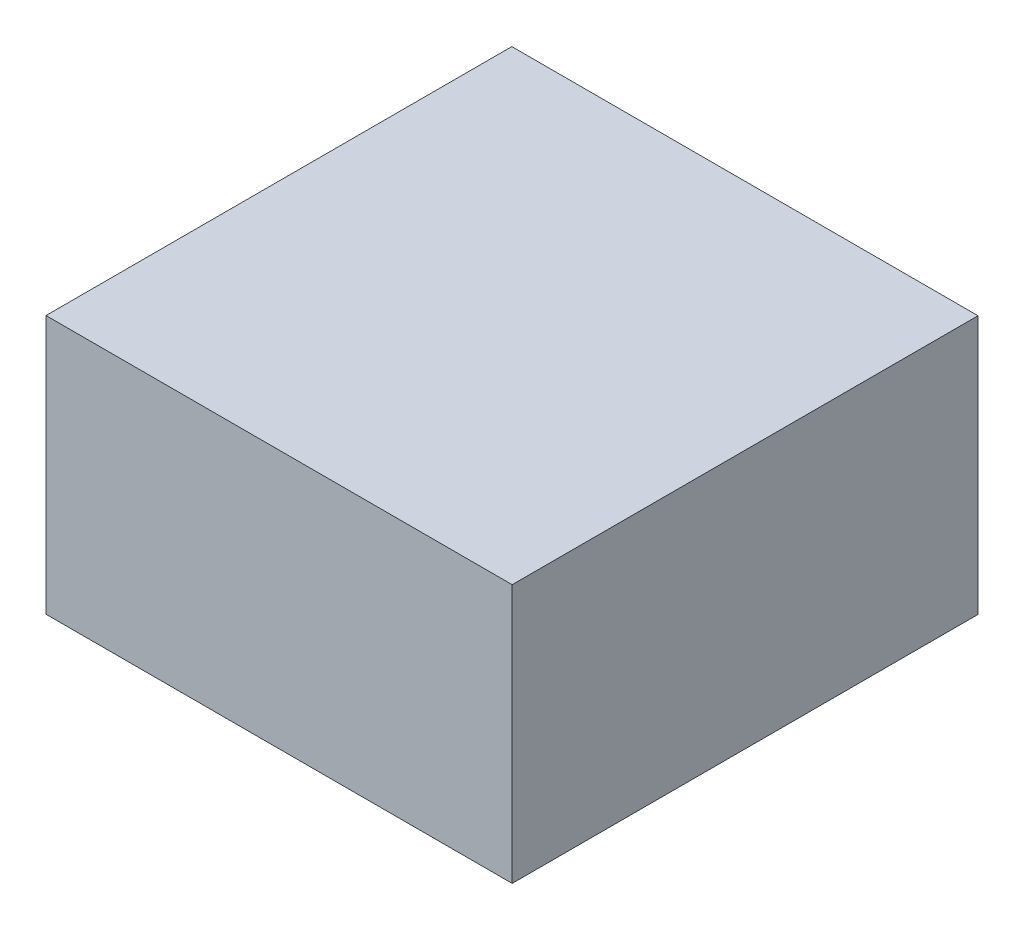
ISO-10303-21;
HEADER;
FILE_DESCRIPTION(('STEP AP214'),'2;1');
FILE_NAME('part.step','',(''),(''),'','','');
FILE_SCHEMA(('AUTOMOTIVE_DESIGN { 1 0 10303 214 1 1 1 1 }'));
ENDSEC;
DATA;
#1=APPLICATION_CONTEXT('core data for automotive mechanical design processes');
#2=APPLICATION_PROTOCOL_DEFINITION('international standard','automotive_design',2000,#1);
#3=PRODUCT_CONTEXT('',#1,'mechanical');
#4=PRODUCT('Part','Part','',(#3));
#5=PRODUCT_RELATED_PRODUCT_CATEGORY('part','',(#4));
#6=PRODUCT_DEFINITION_FORMATION('','',#4);
#7=PRODUCT_DEFINITION_CONTEXT('part definition',#1,'design');
#8=PRODUCT_DEFINITION('design','',#6,#7);
#9=PRODUCT_DEFINITION_SHAPE('','',#8);
#10=(LENGTH_UNIT() NAMED_UNIT(*) SI_UNIT(.MILLI.,.METRE.));
#11=(NAMED_UNIT(*) PLANE_ANGLE_UNIT() SI_UNIT($,.RADIAN.));
#12=(NAMED_UNIT(*) SI_UNIT($,.STERADIAN.) SOLID_ANGLE_UNIT());
#13=UNCERTAINTY_MEASURE_WITH_UNIT(LENGTH_MEASURE(1.E-05),#10,'distance_accuracy_value','');
#14=(GEOMETRIC_REPRESENTATION_CONTEXT(3) GLOBAL_UNCERTAINTY_ASSIGNED_CONTEXT((#13)) GLOBAL_UNIT_ASSIGNED_CONTEXT((#10,
#11,#12)) REPRESENTATION_CONTEXT('',''));
#15=CARTESIAN_POINT('',(0.,0.,0.));
#16=DIRECTION('',(0.,0.,1.));
#17=DIRECTION('',(1.,0.,0.));
#18=AXIS2_PLACEMENT_3D('',#15,#16,#17);
#19=CARTESIAN_POINT('',(-52.1567345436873,149.741718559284,-73.1758296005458));
#20=DIRECTION('',(0.,-1.,0.));
#21=DIRECTION('',(0.,0.,-1.));
#22=AXIS2_PLACEMENT_3D('',#19,#20,#21);
#23=PLANE('',#22);
#24=DIRECTION('',(1.,0.,0.));
#25=VECTOR('',#24,1.);
#26=CARTESIAN_POINT('',(-52.1567345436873,149.741718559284,-73.1758296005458));
#27=LINE('',#26,#25);
#28=CARTESIAN_POINT('',(-62.7811775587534,149.741718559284,-73.1758296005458));
#29=VERTEX_POINT('',#28);
#30=CARTESIAN_POINT('',(-41.5322915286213,149.741718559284,-73.1758296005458));
#31=VERTEX_POINT('',#30);
#32=EDGE_CURVE('E68',#29,#31,#27,.T.);
#33=ORIENTED_EDGE('',*,*,#32,.T.);
#34=DIRECTION('',(0.,0.,-1.));
#35=VECTOR('',#34,1.);
#36=CARTESIAN_POINT('',(-41.5322915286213,149.741718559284,-73.1758296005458));
#37=LINE('',#36,#35);
#38=CARTESIAN_POINT('',(-41.5322915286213,149.741718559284,-51.9436533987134));
#39=VERTEX_POINT('',#38);
#40=EDGE_CURVE('E55',#39,#31,#37,.T.);
#41=ORIENTED_EDGE('',*,*,#40,.F.);
#42=DIRECTION('',(1.,0.,0.));
#43=VECTOR('',#42,1.);
#44=CARTESIAN_POINT('',(-52.1567345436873,149.741718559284,-51.9436533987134));
#45=LINE('',#44,#43);
#46=CARTESIAN_POINT('',(-62.7811775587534,149.741718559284,-51.9436533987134));
#47=VERTEX_POINT('',#46);
#48=EDGE_CURVE('E20',#47,#39,#45,.T.);
#49=ORIENTED_EDGE('',*,*,#48,.F.);
#50=DIRECTION('',(0.,0.,1.));
#51=VECTOR('',#50,1.);
#52=CARTESIAN_POINT('',(-62.7811775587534,149.741718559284,-73.1758296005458));
#53=LINE('',#52,#51);
#54=EDGE_CURVE('E81',#29,#47,#53,.T.);
#55=ORIENTED_EDGE('',*,*,#54,.F.);
#56=EDGE_LOOP('',(#33,#41,#49,#55));
#57=FACE_BOUND('',#56,.T.);
#58=ADVANCED_FACE('F17',(#57),#23,.T.);
#59=CARTESIAN_POINT('',(-52.1567345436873,155.637959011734,-51.9436533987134));
#60=DIRECTION('',(0.,0.,1.));
#61=DIRECTION('',(1.,0.,0.));
#62=AXIS2_PLACEMENT_3D('',#59,#60,#61);
#63=PLANE('',#62);
#64=DIRECTION('',(0.,1.,0.));
#65=VECTOR('',#64,1.);
#66=CARTESIAN_POINT('',(-41.5322915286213,155.637959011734,-51.9436533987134));
#67=LINE('',#66,#65);
#68=CARTESIAN_POINT('',(-41.5322915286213,161.534199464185,-51.9436533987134));
#69=VERTEX_POINT('',#68);
#70=EDGE_CURVE('E61',#69,#39,#67,.F.);
#71=ORIENTED_EDGE('',*,*,#70,.F.);
#72=DIRECTION('',(1.,0.,0.));
#73=VECTOR('',#72,1.);
#74=CARTESIAN_POINT('',(-52.1567345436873,161.534199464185,-51.9436533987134));
#75=LINE('',#74,#73);
#76=CARTESIAN_POINT('',(-62.7811775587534,161.534199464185,-51.9436533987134));
#77=VERTEX_POINT('',#76);
#78=EDGE_CURVE('E83',#77,#69,#75,.T.);
#79=ORIENTED_EDGE('',*,*,#78,.F.);
#80=DIRECTION('',(0.,1.,0.));
#81=VECTOR('',#80,1.);
#82=CARTESIAN_POINT('',(-62.7811775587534,155.637959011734,-51.9436533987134));
#83=LINE('',#82,#81);
#84=EDGE_CURVE('E64',#47,#77,#83,.T.);
#85=ORIENTED_EDGE('',*,*,#84,.F.);
#86=ORIENTED_EDGE('',*,*,#48,.T.);
#87=EDGE_LOOP('',(#71,#79,#85,#86));
#88=FACE_BOUND('',#87,.T.);
#89=ADVANCED_FACE('F60',(#88),#63,.T.);
#90=CARTESIAN_POINT('',(-41.5322915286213,155.637959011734,-73.1758296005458));
#91=DIRECTION('',(1.,0.,0.));
#92=DIRECTION('',(0.,0.,-1.));
#93=AXIS2_PLACEMENT_3D('',#90,#91,#92);
#94=PLANE('',#93);
#95=DIRECTION('',(0.,1.,0.));
#96=VECTOR('',#95,1.);
#97=CARTESIAN_POINT('',(-41.5322915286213,155.637959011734,-73.1758296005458));
#98=LINE('',#97,#96);
#99=CARTESIAN_POINT('',(-41.5322915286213,161.534199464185,-73.1758296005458));
#100=VERTEX_POINT('',#99);
#101=EDGE_CURVE('E70',#31,#100,#98,.T.);
#102=ORIENTED_EDGE('',*,*,#101,.T.);
#103=DIRECTION('',(0.,0.,1.));
#104=VECTOR('',#103,1.);
#105=CARTESIAN_POINT('',(-41.5322915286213,161.534199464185,-73.1758296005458));
#106=LINE('',#105,#104);
#107=EDGE_CURVE('E74',#69,#100,#106,.F.);
#108=ORIENTED_EDGE('',*,*,#107,.F.);
#109=ORIENTED_EDGE('',*,*,#70,.T.);
#110=ORIENTED_EDGE('',*,*,#40,.T.);
#111=EDGE_LOOP('',(#102,#108,#109,#110));
#112=FACE_BOUND('',#111,.T.);
#113=ADVANCED_FACE('F72',(#112),#94,.T.);
#114=CARTESIAN_POINT('',(-52.1567345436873,155.637959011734,-73.1758296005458));
#115=DIRECTION('',(0.,0.,1.));
#116=DIRECTION('',(1.,0.,0.));
#117=AXIS2_PLACEMENT_3D('',#114,#115,#116);
#118=PLANE('',#117);
#119=DIRECTION('',(0.,1.,0.));
#120=VECTOR('',#119,1.);
#121=CARTESIAN_POINT('',(-62.7811775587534,155.637959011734,-73.1758296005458));
#122=LINE('',#121,#120);
#123=CARTESIAN_POINT('',(-62.7811775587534,161.534199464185,-73.1758296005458));
#124=VERTEX_POINT('',#123);
#125=EDGE_CURVE('E35',#124,#29,#122,.F.);
#126=ORIENTED_EDGE('',*,*,#125,.F.);
#127=DIRECTION('',(1.,0.,0.));
#128=VECTOR('',#127,1.);
#129=CARTESIAN_POINT('',(-52.1567345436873,161.534199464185,-73.1758296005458));
#130=LINE('',#129,#128);
#131=EDGE_CURVE('E26',#100,#124,#130,.F.);
#132=ORIENTED_EDGE('',*,*,#131,.F.);
#133=ORIENTED_EDGE('',*,*,#101,.F.);
#134=ORIENTED_EDGE('',*,*,#32,.F.);
#135=EDGE_LOOP('',(#126,#132,#133,#134));
#136=FACE_BOUND('',#135,.T.);
#137=ADVANCED_FACE('F89',(#136),#118,.F.);
#138=CARTESIAN_POINT('',(-62.7811775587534,155.637959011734,-73.1758296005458));
#139=DIRECTION('',(-1.,0.,0.));
#140=DIRECTION('',(0.,0.,1.));
#141=AXIS2_PLACEMENT_3D('',#138,#139,#140);
#142=PLANE('',#141);
#143=ORIENTED_EDGE('',*,*,#125,.T.);
#144=ORIENTED_EDGE('',*,*,#54,.T.);
#145=ORIENTED_EDGE('',*,*,#84,.T.);
#146=DIRECTION('',(0.,0.,1.));
#147=VECTOR('',#146,1.);
#148=CARTESIAN_POINT('',(-62.7811775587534,161.534199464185,-73.1758296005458));
#149=LINE('',#148,#147);
#150=EDGE_CURVE('E11',#124,#77,#149,.T.);
#151=ORIENTED_EDGE('',*,*,#150,.F.);
#152=EDGE_LOOP('',(#143,#144,#145,#151));
#153=FACE_BOUND('',#152,.T.);
#154=ADVANCED_FACE('F91',(#153),#142,.T.);
#155=CARTESIAN_POINT('',(-52.1567345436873,161.534199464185,-73.1758296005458));
#156=DIRECTION('',(0.,1.,0.));
#157=DIRECTION('',(0.,0.,1.));
#158=AXIS2_PLACEMENT_3D('',#155,#156,#157);
#159=PLANE('',#158);
#160=ORIENTED_EDGE('',*,*,#131,.T.);
#161=ORIENTED_EDGE('',*,*,#150,.T.);
#162=ORIENTED_EDGE('',*,*,#78,.T.);
#163=ORIENTED_EDGE('',*,*,#107,.T.);
#164=EDGE_LOOP('',(#160,#161,#162,#163));
#165=FACE_BOUND('',#164,.T.);
#166=ADVANCED_FACE('F88',(#165),#159,.T.);
#167=CLOSED_SHELL('',(#58,#89,#113,#137,#154,#166));
#168=MANIFOLD_SOLID_BREP('B1',#167);
#169=ADVANCED_BREP_SHAPE_REPRESENTATION('',(#18,#168),#14);
#170=SHAPE_DEFINITION_REPRESENTATION(#9,#169);
ENDSEC;
END-ISO-10303-21;
